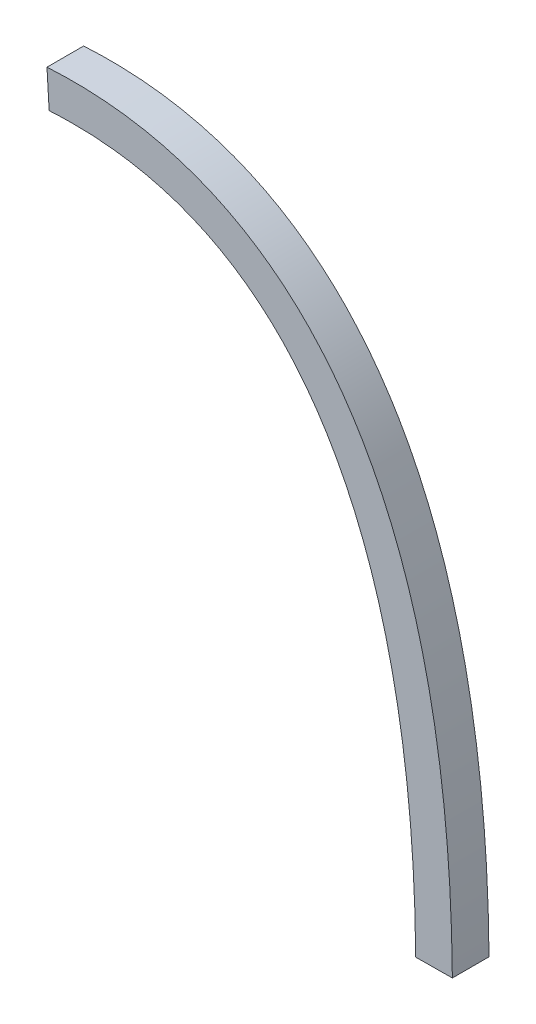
ISO-10303-21;
HEADER;
FILE_DESCRIPTION(('STEP AP214'),'2;1');
FILE_NAME('part.step','',(''),(''),'','','');
FILE_SCHEMA(('AUTOMOTIVE_DESIGN { 1 0 10303 214 1 1 1 1 }'));
ENDSEC;
DATA;
#1=APPLICATION_CONTEXT('core data for automotive mechanical design processes');
#2=APPLICATION_PROTOCOL_DEFINITION('international standard','automotive_design',2000,#1);
#3=PRODUCT_CONTEXT('',#1,'mechanical');
#4=PRODUCT('Part','Part','',(#3));
#5=PRODUCT_RELATED_PRODUCT_CATEGORY('part','',(#4));
#6=PRODUCT_DEFINITION_FORMATION('','',#4);
#7=PRODUCT_DEFINITION_CONTEXT('part definition',#1,'design');
#8=PRODUCT_DEFINITION('design','',#6,#7);
#9=PRODUCT_DEFINITION_SHAPE('','',#8);
#10=(LENGTH_UNIT() NAMED_UNIT(*) SI_UNIT(.MILLI.,.METRE.));
#11=(NAMED_UNIT(*) PLANE_ANGLE_UNIT() SI_UNIT($,.RADIAN.));
#12=(NAMED_UNIT(*) SI_UNIT($,.STERADIAN.) SOLID_ANGLE_UNIT());
#13=UNCERTAINTY_MEASURE_WITH_UNIT(LENGTH_MEASURE(1.E-05),#10,'distance_accuracy_value','');
#14=(GEOMETRIC_REPRESENTATION_CONTEXT(3) GLOBAL_UNCERTAINTY_ASSIGNED_CONTEXT((#13)) GLOBAL_UNIT_ASSIGNED_CONTEXT((#10,
#11,#12)) REPRESENTATION_CONTEXT('',''));
#15=CARTESIAN_POINT('',(0.,0.,0.));
#16=DIRECTION('',(0.,0.,1.));
#17=DIRECTION('',(1.,0.,0.));
#18=AXIS2_PLACEMENT_3D('',#15,#16,#17);
#19=CARTESIAN_POINT('',(9.99967119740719,0.0810921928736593,10.));
#20=CARTESIAN_POINT('',(9.93799077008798,7.68705240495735,10.));
#21=CARTESIAN_POINT('',(9.67942281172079,15.8866768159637,10.));
#22=CARTESIAN_POINT('',(8.51571528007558,32.9535411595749,10.));
#23=CARTESIAN_POINT('',(7.61093765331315,41.8208300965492,10.));
#24=CARTESIAN_POINT('',(4.88959143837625,59.715902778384,10.));
#25=CARTESIAN_POINT('',(3.07373661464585,68.7439749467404,10.));
#26=CARTESIAN_POINT('',(-1.76324878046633,86.462672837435,10.));
#27=CARTESIAN_POINT('',(-4.7835557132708,95.1549868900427,10.));
#28=CARTESIAN_POINT('',(-10.4783151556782,107.555877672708,10.));
#29=CARTESIAN_POINT('',(-12.5711879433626,111.582993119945,10.));
#30=CARTESIAN_POINT('',(-17.1950995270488,119.351230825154,10.));
#31=CARTESIAN_POINT('',(-19.7263534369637,123.092513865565,10.));
#32=CARTESIAN_POINT('',(-25.2756478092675,130.204759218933,10.));
#33=CARTESIAN_POINT('',(-28.2940790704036,133.575721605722,10.));
#34=CARTESIAN_POINT('',(-34.85676455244,139.848123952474,10.));
#35=CARTESIAN_POINT('',(-38.4013679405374,142.749180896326,10.));
#36=CARTESIAN_POINT('',(-46.0335674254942,147.972698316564,10.));
#37=CARTESIAN_POINT('',(-50.1210219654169,150.294491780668,10.));
#38=CARTESIAN_POINT('',(-58.8294100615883,154.257248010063,10.));
#39=CARTESIAN_POINT('',(-63.4496380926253,155.897849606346,10.));
#40=CARTESIAN_POINT('',(-73.2005901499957,158.420706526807,10.));
#41=CARTESIAN_POINT('',(-78.3306674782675,159.303240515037,10.));
#42=CARTESIAN_POINT('',(-89.0878564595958,160.258920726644,10.));
#43=CARTESIAN_POINT('',(-94.7148525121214,160.332591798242,10.));
#44=CARTESIAN_POINT('',(-100.594693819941,159.982301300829,10.));
#45=B_SPLINE_CURVE_WITH_KNOTS('',3,(#19,#20,#21,#22,#23,#24,#25,#26,#27,#28,#29,#30,#31,#32,#33,
#34,#35,#36,#37,#38,#39,#40,#41,#42,#43,#44),.UNSPECIFIED.,.F.,.F.,(4,2,2,2,2,2,2,2,2,2,2,2,4),
(0.,0.125,0.25,0.375,0.5,0.5625,0.625,0.6875,0.75,0.8125,0.875,0.9375,1.),.UNSPECIFIED.);
#46=DIRECTION('',(0.,0.,-1.));
#47=VECTOR('',#46,1.);
#48=SURFACE_OF_LINEAR_EXTRUSION('',#45,#47);
#49=CARTESIAN_POINT('',(9.99967119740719,0.0810921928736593,0.));
#50=CARTESIAN_POINT('',(9.93799077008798,7.68705240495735,0.));
#51=CARTESIAN_POINT('',(9.67942281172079,15.8866768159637,0.));
#52=CARTESIAN_POINT('',(8.51571528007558,32.9535411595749,0.));
#53=CARTESIAN_POINT('',(7.61093765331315,41.8208300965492,0.));
#54=CARTESIAN_POINT('',(4.88959143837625,59.715902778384,0.));
#55=CARTESIAN_POINT('',(3.07373661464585,68.7439749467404,0.));
#56=CARTESIAN_POINT('',(-1.76324878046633,86.462672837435,0.));
#57=CARTESIAN_POINT('',(-4.7835557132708,95.1549868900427,0.));
#58=CARTESIAN_POINT('',(-10.4783151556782,107.555877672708,0.));
#59=CARTESIAN_POINT('',(-12.5711879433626,111.582993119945,0.));
#60=CARTESIAN_POINT('',(-17.1950995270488,119.351230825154,0.));
#61=CARTESIAN_POINT('',(-19.7263534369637,123.092513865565,0.));
#62=CARTESIAN_POINT('',(-25.2756478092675,130.204759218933,0.));
#63=CARTESIAN_POINT('',(-28.2940790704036,133.575721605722,0.));
#64=CARTESIAN_POINT('',(-34.85676455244,139.848123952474,0.));
#65=CARTESIAN_POINT('',(-38.4013679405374,142.749180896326,0.));
#66=CARTESIAN_POINT('',(-46.0335674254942,147.972698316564,0.));
#67=CARTESIAN_POINT('',(-50.1210219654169,150.294491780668,0.));
#68=CARTESIAN_POINT('',(-58.8294100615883,154.257248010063,0.));
#69=CARTESIAN_POINT('',(-63.4496380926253,155.897849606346,0.));
#70=CARTESIAN_POINT('',(-73.2005901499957,158.420706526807,0.));
#71=CARTESIAN_POINT('',(-78.3306674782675,159.303240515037,0.));
#72=CARTESIAN_POINT('',(-89.0878564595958,160.258920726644,0.));
#73=CARTESIAN_POINT('',(-94.7148525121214,160.332591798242,0.));
#74=CARTESIAN_POINT('',(-100.594693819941,159.982301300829,0.));
#75=B_SPLINE_CURVE_WITH_KNOTS('',3,(#49,#50,#51,#52,#53,#54,#55,#56,#57,#58,#59,#60,#61,#62,#63,
#64,#65,#66,#67,#68,#69,#70,#71,#72,#73,#74),.UNSPECIFIED.,.F.,.F.,(4,2,2,2,2,2,2,2,2,2,2,2,4),
(0.,0.125,0.25,0.375,0.5,0.5625,0.625,0.6875,0.75,0.8125,0.875,0.9375,1.),.UNSPECIFIED.);
#76=CARTESIAN_POINT('',(9.99967119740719,0.0810921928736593,0.));
#77=VERTEX_POINT('',#76);
#78=CARTESIAN_POINT('',(-100.594693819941,159.982301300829,0.));
#79=VERTEX_POINT('',#78);
#80=EDGE_CURVE('E113',#77,#79,#75,.T.);
#81=ORIENTED_EDGE('',*,*,#80,.T.);
#82=DIRECTION('',(0.,0.,-1.));
#83=VECTOR('',#82,1.);
#84=CARTESIAN_POINT('',(-100.594693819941,159.982301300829,10.));
#85=LINE('',#84,#83);
#86=CARTESIAN_POINT('',(-100.594693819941,159.982301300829,10.));
#87=VERTEX_POINT('',#86);
#88=EDGE_CURVE('E11',#87,#79,#85,.T.);
#89=ORIENTED_EDGE('',*,*,#88,.F.);
#90=CARTESIAN_POINT('',(9.99967119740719,0.0810921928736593,10.));
#91=VERTEX_POINT('',#90);
#92=EDGE_CURVE('E74',#91,#87,#45,.T.);
#93=ORIENTED_EDGE('',*,*,#92,.F.);
#94=DIRECTION('',(0.,0.,-1.));
#95=VECTOR('',#94,1.);
#96=CARTESIAN_POINT('',(9.99967119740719,0.0810921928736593,10.));
#97=LINE('',#96,#95);
#98=EDGE_CURVE('E50',#91,#77,#97,.T.);
#99=ORIENTED_EDGE('',*,*,#98,.T.);
#100=EDGE_LOOP('',(#81,#89,#93,#99));
#101=FACE_BOUND('',#100,.T.);
#102=ADVANCED_FACE('F33',(#101),#48,.F.);
#103=CARTESIAN_POINT('',(-100.,150.,10.));
#104=DIRECTION('',(-0.998230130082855,-0.0594693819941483,0.));
#105=DIRECTION('',(0.0594693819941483,-0.998230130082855,0.));
#106=AXIS2_PLACEMENT_3D('',#103,#104,#105);
#107=PLANE('',#106);
#108=DIRECTION('',(-0.0594693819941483,0.998230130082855,0.));
#109=VECTOR('',#108,1.);
#110=CARTESIAN_POINT('',(-100.,150.,0.));
#111=LINE('',#110,#109);
#112=CARTESIAN_POINT('',(-100.,150.,0.));
#113=VERTEX_POINT('',#112);
#114=EDGE_CURVE('E83',#113,#79,#111,.T.);
#115=ORIENTED_EDGE('',*,*,#114,.F.);
#116=DIRECTION('',(0.,0.,-1.));
#117=VECTOR('',#116,1.);
#118=CARTESIAN_POINT('',(-100.,150.,10.));
#119=LINE('',#118,#117);
#120=CARTESIAN_POINT('',(-100.,150.,10.));
#121=VERTEX_POINT('',#120);
#122=EDGE_CURVE('E42',#121,#113,#119,.T.);
#123=ORIENTED_EDGE('',*,*,#122,.F.);
#124=DIRECTION('',(-0.0594693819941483,0.998230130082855,0.));
#125=VECTOR('',#124,1.);
#126=CARTESIAN_POINT('',(-100.,150.,10.));
#127=LINE('',#126,#125);
#128=EDGE_CURVE('E81',#121,#87,#127,.T.);
#129=ORIENTED_EDGE('',*,*,#128,.T.);
#130=ORIENTED_EDGE('',*,*,#88,.T.);
#131=EDGE_LOOP('',(#115,#123,#129,#130));
#132=FACE_BOUND('',#131,.T.);
#133=ADVANCED_FACE('F80',(#132),#107,.T.);
#134=CARTESIAN_POINT('',(0.,0.,10.));
#135=CARTESIAN_POINT('',(-0.4825048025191,59.4988149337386,10.));
#136=CARTESIAN_POINT('',(-13.2978941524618,155.165262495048,10.));
#137=CARTESIAN_POINT('',(-100.,150.,10.));
#138=B_SPLINE_CURVE_WITH_KNOTS('',3,(#134,#135,#136,#137),.UNSPECIFIED.,.F.,.F.,(4,4),(0.,1.),.UNSPECIFIED.);
#139=DIRECTION('',(0.,0.,-1.));
#140=VECTOR('',#139,1.);
#141=SURFACE_OF_LINEAR_EXTRUSION('',#138,#140);
#142=CARTESIAN_POINT('',(0.,0.,0.));
#143=CARTESIAN_POINT('',(-0.4825048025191,59.4988149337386,0.));
#144=CARTESIAN_POINT('',(-13.2978941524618,155.165262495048,0.));
#145=CARTESIAN_POINT('',(-100.,150.,0.));
#146=B_SPLINE_CURVE_WITH_KNOTS('',3,(#142,#143,#144,#145),.UNSPECIFIED.,.F.,.F.,(4,4),(0.,1.),.UNSPECIFIED.);
#147=CARTESIAN_POINT('',(0.,0.,0.));
#148=VERTEX_POINT('',#147);
#149=EDGE_CURVE('E117',#148,#113,#146,.T.);
#150=ORIENTED_EDGE('',*,*,#149,.F.);
#151=DIRECTION('',(0.,0.,-1.));
#152=VECTOR('',#151,1.);
#153=CARTESIAN_POINT('',(0.,0.,10.));
#154=LINE('',#153,#152);
#155=CARTESIAN_POINT('',(0.,0.,10.));
#156=VERTEX_POINT('',#155);
#157=EDGE_CURVE('E63',#156,#148,#154,.T.);
#158=ORIENTED_EDGE('',*,*,#157,.F.);
#159=EDGE_CURVE('E89',#156,#121,#138,.T.);
#160=ORIENTED_EDGE('',*,*,#159,.T.);
#161=ORIENTED_EDGE('',*,*,#122,.T.);
#162=EDGE_LOOP('',(#150,#158,#160,#161));
#163=FACE_BOUND('',#162,.T.);
#164=ADVANCED_FACE('F91',(#163),#141,.T.);
#165=CARTESIAN_POINT('',(9.99967119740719,0.0810921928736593,10.));
#166=DIRECTION('',(0.00810921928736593,-0.999967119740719,0.));
#167=DIRECTION('',(0.999967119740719,0.00810921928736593,0.));
#168=AXIS2_PLACEMENT_3D('',#165,#166,#167);
#169=PLANE('',#168);
#170=DIRECTION('',(-0.999967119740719,-0.00810921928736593,0.));
#171=VECTOR('',#170,1.);
#172=CARTESIAN_POINT('',(9.99967119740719,0.0810921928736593,0.));
#173=LINE('',#172,#171);
#174=EDGE_CURVE('E119',#77,#148,#173,.T.);
#175=ORIENTED_EDGE('',*,*,#174,.F.);
#176=ORIENTED_EDGE('',*,*,#98,.F.);
#177=DIRECTION('',(-0.999967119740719,-0.00810921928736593,0.));
#178=VECTOR('',#177,1.);
#179=CARTESIAN_POINT('',(9.99967119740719,0.0810921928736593,10.));
#180=LINE('',#179,#178);
#181=EDGE_CURVE('E92',#91,#156,#180,.T.);
#182=ORIENTED_EDGE('',*,*,#181,.T.);
#183=ORIENTED_EDGE('',*,*,#157,.T.);
#184=EDGE_LOOP('',(#175,#176,#182,#183));
#185=FACE_BOUND('',#184,.T.);
#186=ADVANCED_FACE('F105',(#185),#169,.T.);
#187=CARTESIAN_POINT('',(-8.58006200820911,103.422247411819,10.));
#188=DIRECTION('',(0.,0.,-1.));
#189=DIRECTION('',(-1.,0.,0.));
#190=AXIS2_PLACEMENT_3D('',#187,#188,#189);
#191=PLANE('',#190);
#192=ORIENTED_EDGE('',*,*,#92,.T.);
#193=ORIENTED_EDGE('',*,*,#128,.F.);
#194=ORIENTED_EDGE('',*,*,#159,.F.);
#195=ORIENTED_EDGE('',*,*,#181,.F.);
#196=EDGE_LOOP('',(#192,#193,#194,#195));
#197=FACE_BOUND('',#196,.T.);
#198=ADVANCED_FACE('F88',(#197),#191,.F.);
#199=CARTESIAN_POINT('',(-8.58006200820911,103.422247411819,0.));
#200=DIRECTION('',(0.,0.,-1.));
#201=DIRECTION('',(-1.,0.,0.));
#202=AXIS2_PLACEMENT_3D('',#199,#200,#201);
#203=PLANE('',#202);
#204=ORIENTED_EDGE('',*,*,#80,.F.);
#205=ORIENTED_EDGE('',*,*,#174,.T.);
#206=ORIENTED_EDGE('',*,*,#149,.T.);
#207=ORIENTED_EDGE('',*,*,#114,.T.);
#208=EDGE_LOOP('',(#204,#205,#206,#207));
#209=FACE_BOUND('',#208,.T.);
#210=ADVANCED_FACE('F116',(#209),#203,.T.);
#211=CLOSED_SHELL('',(#102,#133,#164,#186,#198,#210));
#212=MANIFOLD_SOLID_BREP('B2',#211);
#213=ADVANCED_BREP_SHAPE_REPRESENTATION('',(#18,#212),#14);
#214=SHAPE_DEFINITION_REPRESENTATION(#9,#213);
ENDSEC;
END-ISO-10303-21;
